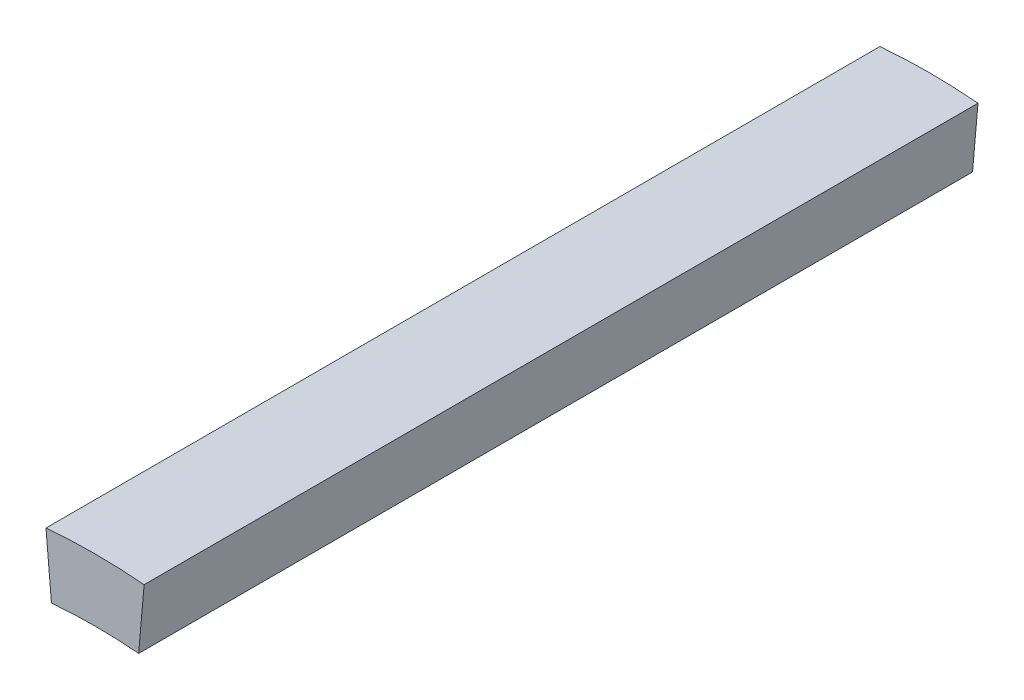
ISO-10303-21;
HEADER;
FILE_DESCRIPTION(('STEP AP214'),'2;1');
FILE_NAME('part.step','',(''),(''),'','','');
FILE_SCHEMA(('AUTOMOTIVE_DESIGN { 1 0 10303 214 1 1 1 1 }'));
ENDSEC;
DATA;
#1=APPLICATION_CONTEXT('core data for automotive mechanical design processes');
#2=APPLICATION_PROTOCOL_DEFINITION('international standard','automotive_design',2000,#1);
#3=PRODUCT_CONTEXT('',#1,'mechanical');
#4=PRODUCT('Part','Part','',(#3));
#5=PRODUCT_RELATED_PRODUCT_CATEGORY('part','',(#4));
#6=PRODUCT_DEFINITION_FORMATION('','',#4);
#7=PRODUCT_DEFINITION_CONTEXT('part definition',#1,'design');
#8=PRODUCT_DEFINITION('design','',#6,#7);
#9=PRODUCT_DEFINITION_SHAPE('','',#8);
#10=(LENGTH_UNIT() NAMED_UNIT(*) SI_UNIT(.MILLI.,.METRE.));
#11=(NAMED_UNIT(*) PLANE_ANGLE_UNIT() SI_UNIT($,.RADIAN.));
#12=(NAMED_UNIT(*) SI_UNIT($,.STERADIAN.) SOLID_ANGLE_UNIT());
#13=UNCERTAINTY_MEASURE_WITH_UNIT(LENGTH_MEASURE(1.E-05),#10,'distance_accuracy_value','');
#14=(GEOMETRIC_REPRESENTATION_CONTEXT(3) GLOBAL_UNCERTAINTY_ASSIGNED_CONTEXT((#13)) GLOBAL_UNIT_ASSIGNED_CONTEXT((#10,
#11,#12)) REPRESENTATION_CONTEXT('',''));
#15=CARTESIAN_POINT('',(0.,0.,0.));
#16=DIRECTION('',(0.,0.,1.));
#17=DIRECTION('',(1.,0.,0.));
#18=AXIS2_PLACEMENT_3D('',#15,#16,#17);
#19=CARTESIAN_POINT('',(0.,0.,10.));
#20=DIRECTION('',(0.,0.,-1.));
#21=DIRECTION('',(-1.,0.,0.));
#22=AXIS2_PLACEMENT_3D('',#19,#20,#21);
#23=CYLINDRICAL_SURFACE('',#22,6.75);
#24=CARTESIAN_POINT('',(0.,0.,0.));
#25=DIRECTION('',(0.,0.,1.));
#26=DIRECTION('',(-1.,0.,0.));
#27=AXIS2_PLACEMENT_3D('',#24,#25,#26);
#28=CIRCLE('',#27,6.75);
#29=CARTESIAN_POINT('',(0.588301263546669,6.72431421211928,0.));
#30=VERTEX_POINT('',#29);
#31=CARTESIAN_POINT('',(-0.588301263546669,6.72431421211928,0.));
#32=VERTEX_POINT('',#31);
#33=EDGE_CURVE('E94',#30,#32,#28,.T.);
#34=ORIENTED_EDGE('',*,*,#33,.T.);
#35=DIRECTION('',(0.,0.,-1.));
#36=VECTOR('',#35,1.);
#37=CARTESIAN_POINT('',(-0.588301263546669,6.72431421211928,10.));
#38=LINE('',#37,#36);
#39=CARTESIAN_POINT('',(-0.588301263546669,6.72431421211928,10.));
#40=VERTEX_POINT('',#39);
#41=EDGE_CURVE('E11',#40,#32,#38,.T.);
#42=ORIENTED_EDGE('',*,*,#41,.F.);
#43=CARTESIAN_POINT('',(0.,0.,10.));
#44=DIRECTION('',(0.,0.,1.));
#45=DIRECTION('',(-1.,0.,0.));
#46=AXIS2_PLACEMENT_3D('',#43,#44,#45);
#47=CIRCLE('',#46,6.75);
#48=CARTESIAN_POINT('',(0.588301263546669,6.72431421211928,10.));
#49=VERTEX_POINT('',#48);
#50=EDGE_CURVE('E82',#49,#40,#47,.T.);
#51=ORIENTED_EDGE('',*,*,#50,.F.);
#52=DIRECTION('',(0.,0.,-1.));
#53=VECTOR('',#52,1.);
#54=CARTESIAN_POINT('',(0.588301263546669,6.72431421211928,10.));
#55=LINE('',#54,#53);
#56=EDGE_CURVE('E90',#49,#30,#55,.T.);
#57=ORIENTED_EDGE('',*,*,#56,.T.);
#58=EDGE_LOOP('',(#34,#42,#51,#57));
#59=FACE_BOUND('',#58,.T.);
#60=ADVANCED_FACE('F31',(#59),#23,.T.);
#61=CARTESIAN_POINT('',(-0.588301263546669,6.72431421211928,10.));
#62=DIRECTION('',(0.996194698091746,0.0871557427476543,0.));
#63=DIRECTION('',(-0.0871557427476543,0.996194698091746,0.));
#64=AXIS2_PLACEMENT_3D('',#61,#62,#63);
#65=PLANE('',#64);
#66=DIRECTION('',(0.0871557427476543,-0.996194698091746,0.));
#67=VECTOR('',#66,1.);
#68=CARTESIAN_POINT('',(-0.588301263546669,6.72431421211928,0.));
#69=LINE('',#68,#67);
#70=CARTESIAN_POINT('',(-0.522934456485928,5.97716818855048,0.));
#71=VERTEX_POINT('',#70);
#72=EDGE_CURVE('E86',#32,#71,#69,.T.);
#73=ORIENTED_EDGE('',*,*,#72,.T.);
#74=DIRECTION('',(0.,0.,-1.));
#75=VECTOR('',#74,1.);
#76=CARTESIAN_POINT('',(-0.522934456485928,5.97716818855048,10.));
#77=LINE('',#76,#75);
#78=CARTESIAN_POINT('',(-0.522934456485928,5.97716818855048,10.));
#79=VERTEX_POINT('',#78);
#80=EDGE_CURVE('E39',#79,#71,#77,.T.);
#81=ORIENTED_EDGE('',*,*,#80,.F.);
#82=DIRECTION('',(0.0871557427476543,-0.996194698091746,0.));
#83=VECTOR('',#82,1.);
#84=CARTESIAN_POINT('',(-0.588301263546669,6.72431421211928,10.));
#85=LINE('',#84,#83);
#86=EDGE_CURVE('E77',#40,#79,#85,.T.);
#87=ORIENTED_EDGE('',*,*,#86,.F.);
#88=ORIENTED_EDGE('',*,*,#41,.T.);
#89=EDGE_LOOP('',(#73,#81,#87,#88));
#90=FACE_BOUND('',#89,.T.);
#91=ADVANCED_FACE('F85',(#90),#65,.F.);
#92=CARTESIAN_POINT('',(0.,0.,10.));
#93=DIRECTION('',(0.,0.,-1.));
#94=DIRECTION('',(-1.,0.,0.));
#95=AXIS2_PLACEMENT_3D('',#92,#93,#94);
#96=CYLINDRICAL_SURFACE('',#95,6.);
#97=CARTESIAN_POINT('',(0.,0.,0.));
#98=DIRECTION('',(0.,0.,-1.));
#99=DIRECTION('',(-1.,0.,0.));
#100=AXIS2_PLACEMENT_3D('',#97,#98,#99);
#101=CIRCLE('',#100,6.);
#102=CARTESIAN_POINT('',(0.522934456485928,5.97716818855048,0.));
#103=VERTEX_POINT('',#102);
#104=EDGE_CURVE('E64',#71,#103,#101,.T.);
#105=ORIENTED_EDGE('',*,*,#104,.T.);
#106=DIRECTION('',(0.,0.,-1.));
#107=VECTOR('',#106,1.);
#108=CARTESIAN_POINT('',(0.522934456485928,5.97716818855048,10.));
#109=LINE('',#108,#107);
#110=CARTESIAN_POINT('',(0.522934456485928,5.97716818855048,10.));
#111=VERTEX_POINT('',#110);
#112=EDGE_CURVE('E87',#111,#103,#109,.T.);
#113=ORIENTED_EDGE('',*,*,#112,.F.);
#114=CARTESIAN_POINT('',(0.,0.,10.));
#115=DIRECTION('',(0.,0.,-1.));
#116=DIRECTION('',(-1.,0.,0.));
#117=AXIS2_PLACEMENT_3D('',#114,#115,#116);
#118=CIRCLE('',#117,6.);
#119=EDGE_CURVE('E80',#79,#111,#118,.T.);
#120=ORIENTED_EDGE('',*,*,#119,.F.);
#121=ORIENTED_EDGE('',*,*,#80,.T.);
#122=EDGE_LOOP('',(#105,#113,#120,#121));
#123=FACE_BOUND('',#122,.T.);
#124=ADVANCED_FACE('F88',(#123),#96,.F.);
#125=CARTESIAN_POINT('',(0.522934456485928,5.97716818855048,10.));
#126=DIRECTION('',(-0.996194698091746,0.0871557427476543,0.));
#127=DIRECTION('',(-0.0871557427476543,-0.996194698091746,0.));
#128=AXIS2_PLACEMENT_3D('',#125,#126,#127);
#129=PLANE('',#128);
#130=DIRECTION('',(0.0871557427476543,0.996194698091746,0.));
#131=VECTOR('',#130,1.);
#132=CARTESIAN_POINT('',(0.522934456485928,5.97716818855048,0.));
#133=LINE('',#132,#131);
#134=EDGE_CURVE('E70',#103,#30,#133,.T.);
#135=ORIENTED_EDGE('',*,*,#134,.T.);
#136=ORIENTED_EDGE('',*,*,#56,.F.);
#137=DIRECTION('',(0.0871557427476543,0.996194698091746,0.));
#138=VECTOR('',#137,1.);
#139=CARTESIAN_POINT('',(0.522934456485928,5.97716818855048,10.));
#140=LINE('',#139,#138);
#141=EDGE_CURVE('E47',#111,#49,#140,.T.);
#142=ORIENTED_EDGE('',*,*,#141,.F.);
#143=ORIENTED_EDGE('',*,*,#112,.T.);
#144=EDGE_LOOP('',(#135,#136,#142,#143));
#145=FACE_BOUND('',#144,.T.);
#146=ADVANCED_FACE('F101',(#145),#129,.F.);
#147=CARTESIAN_POINT('',(0.,0.,10.));
#148=DIRECTION('',(0.,0.,-1.));
#149=DIRECTION('',(-1.,0.,0.));
#150=AXIS2_PLACEMENT_3D('',#147,#148,#149);
#151=PLANE('',#150);
#152=ORIENTED_EDGE('',*,*,#50,.T.);
#153=ORIENTED_EDGE('',*,*,#86,.T.);
#154=ORIENTED_EDGE('',*,*,#119,.T.);
#155=ORIENTED_EDGE('',*,*,#141,.T.);
#156=EDGE_LOOP('',(#152,#153,#154,#155));
#157=FACE_BOUND('',#156,.T.);
#158=ADVANCED_FACE('F78',(#157),#151,.F.);
#159=CARTESIAN_POINT('',(0.,0.,0.));
#160=DIRECTION('',(0.,0.,-1.));
#161=DIRECTION('',(-1.,0.,0.));
#162=AXIS2_PLACEMENT_3D('',#159,#160,#161);
#163=PLANE('',#162);
#164=ORIENTED_EDGE('',*,*,#33,.F.);
#165=ORIENTED_EDGE('',*,*,#134,.F.);
#166=ORIENTED_EDGE('',*,*,#104,.F.);
#167=ORIENTED_EDGE('',*,*,#72,.F.);
#168=EDGE_LOOP('',(#164,#165,#166,#167));
#169=FACE_BOUND('',#168,.T.);
#170=ADVANCED_FACE('F104',(#169),#163,.T.);
#171=CLOSED_SHELL('',(#60,#91,#124,#146,#158,#170));
#172=MANIFOLD_SOLID_BREP('B2',#171);
#173=ADVANCED_BREP_SHAPE_REPRESENTATION('',(#18,#172),#14);
#174=SHAPE_DEFINITION_REPRESENTATION(#9,#173);
ENDSEC;
END-ISO-10303-21;
